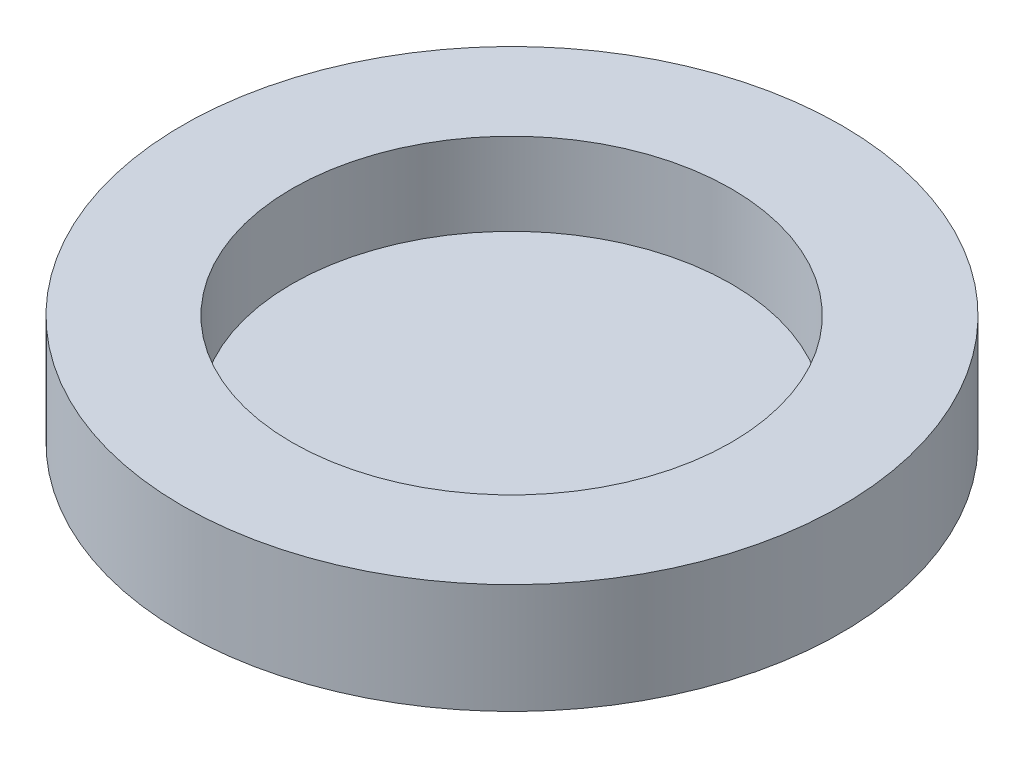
ISO-10303-21;
HEADER;
FILE_DESCRIPTION(('STEP AP214'),'2;1');
FILE_NAME('part.step','',(''),(''),'','','');
FILE_SCHEMA(('AUTOMOTIVE_DESIGN { 1 0 10303 214 1 1 1 1 }'));
ENDSEC;
DATA;
#1=APPLICATION_CONTEXT('core data for automotive mechanical design processes');
#2=APPLICATION_PROTOCOL_DEFINITION('international standard','automotive_design',2000,#1);
#3=PRODUCT_CONTEXT('',#1,'mechanical');
#4=PRODUCT('Part','Part','',(#3));
#5=PRODUCT_RELATED_PRODUCT_CATEGORY('part','',(#4));
#6=PRODUCT_DEFINITION_FORMATION('','',#4);
#7=PRODUCT_DEFINITION_CONTEXT('part definition',#1,'design');
#8=PRODUCT_DEFINITION('design','',#6,#7);
#9=PRODUCT_DEFINITION_SHAPE('','',#8);
#10=(LENGTH_UNIT() NAMED_UNIT(*) SI_UNIT(.MILLI.,.METRE.));
#11=(NAMED_UNIT(*) PLANE_ANGLE_UNIT() SI_UNIT($,.RADIAN.));
#12=(NAMED_UNIT(*) SI_UNIT($,.STERADIAN.) SOLID_ANGLE_UNIT());
#13=UNCERTAINTY_MEASURE_WITH_UNIT(LENGTH_MEASURE(1.E-05),#10,'distance_accuracy_value','');
#14=(GEOMETRIC_REPRESENTATION_CONTEXT(3) GLOBAL_UNCERTAINTY_ASSIGNED_CONTEXT((#13)) GLOBAL_UNIT_ASSIGNED_CONTEXT((#10,
#11,#12)) REPRESENTATION_CONTEXT('',''));
#15=CARTESIAN_POINT('',(0.,0.,0.));
#16=DIRECTION('',(0.,0.,1.));
#17=DIRECTION('',(1.,0.,0.));
#18=AXIS2_PLACEMENT_3D('',#15,#16,#17);
#19=CARTESIAN_POINT('',(0.353906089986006,20.,-0.176953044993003));
#20=DIRECTION('',(0.,-1.,0.));
#21=DIRECTION('',(0.,0.,-1.));
#22=AXIS2_PLACEMENT_3D('',#19,#20,#21);
#23=CYLINDRICAL_SURFACE('',#22,60.);
#24=CARTESIAN_POINT('',(0.353906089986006,20.,-0.176953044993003));
#25=DIRECTION('',(0.,1.,0.));
#26=DIRECTION('',(0.,0.,1.));
#27=AXIS2_PLACEMENT_3D('',#24,#25,#26);
#28=CIRCLE('',#27,60.);
#29=CARTESIAN_POINT('',(0.353906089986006,20.,-60.176953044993));
#30=VERTEX_POINT('',#29);
#31=EDGE_CURVE('E10',#30,#30,#28,.T.);
#32=CARTESIAN_POINT('',(0.353906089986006,0.,-0.176953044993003));
#33=DIRECTION('',(0.,1.,0.));
#34=DIRECTION('',(0.,0.,1.));
#35=AXIS2_PLACEMENT_3D('',#32,#33,#34);
#36=CIRCLE('',#35,60.);
#37=CARTESIAN_POINT('',(0.353906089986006,0.,-60.176953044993));
#38=VERTEX_POINT('',#37);
#39=EDGE_CURVE('E36',#38,#38,#36,.T.);
#40=CARTESIAN_POINT('',(0.353906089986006,20.,-60.176953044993));
#41=CARTESIAN_POINT('',(0.353906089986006,19.7916666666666,-60.176953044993));
#42=CARTESIAN_POINT('',(0.353906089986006,19.5833333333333,-60.176953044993));
#43=CARTESIAN_POINT('',(0.353906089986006,19.1666666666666,-60.176953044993));
#44=CARTESIAN_POINT('',(0.353906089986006,18.9583333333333,-60.176953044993));
#45=CARTESIAN_POINT('',(0.353906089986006,18.5416666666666,-60.176953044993));
#46=CARTESIAN_POINT('',(0.353906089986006,18.3333333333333,-60.176953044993));
#47=CARTESIAN_POINT('',(0.353906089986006,17.9166666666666,-60.176953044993));
#48=CARTESIAN_POINT('',(0.353906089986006,17.7083333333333,-60.176953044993));
#49=CARTESIAN_POINT('',(0.353906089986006,17.2916666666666,-60.176953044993));
#50=CARTESIAN_POINT('',(0.353906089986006,17.0833333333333,-60.176953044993));
#51=CARTESIAN_POINT('',(0.353906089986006,16.6666666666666,-60.176953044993));
#52=CARTESIAN_POINT('',(0.353906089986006,16.4583333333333,-60.176953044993));
#53=CARTESIAN_POINT('',(0.353906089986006,16.0416666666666,-60.176953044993));
#54=CARTESIAN_POINT('',(0.353906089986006,15.8333333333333,-60.176953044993));
#55=CARTESIAN_POINT('',(0.353906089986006,15.4166666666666,-60.176953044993));
#56=CARTESIAN_POINT('',(0.353906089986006,15.2083333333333,-60.176953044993));
#57=CARTESIAN_POINT('',(0.353906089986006,14.7916666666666,-60.176953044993));
#58=CARTESIAN_POINT('',(0.353906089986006,14.5833333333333,-60.176953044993));
#59=CARTESIAN_POINT('',(0.353906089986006,14.1666666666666,-60.176953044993));
#60=CARTESIAN_POINT('',(0.353906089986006,13.9583333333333,-60.176953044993));
#61=CARTESIAN_POINT('',(0.353906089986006,13.5416666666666,-60.176953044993));
#62=CARTESIAN_POINT('',(0.353906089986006,13.3333333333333,-60.176953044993));
#63=CARTESIAN_POINT('',(0.353906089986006,12.9166666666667,-60.176953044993));
#64=CARTESIAN_POINT('',(0.353906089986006,12.7083333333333,-60.176953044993));
#65=CARTESIAN_POINT('',(0.353906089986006,12.2916666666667,-60.176953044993));
#66=CARTESIAN_POINT('',(0.353906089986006,12.0833333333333,-60.176953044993));
#67=CARTESIAN_POINT('',(0.353906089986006,11.6666666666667,-60.176953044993));
#68=CARTESIAN_POINT('',(0.353906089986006,11.4583333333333,-60.176953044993));
#69=CARTESIAN_POINT('',(0.353906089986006,11.0416666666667,-60.176953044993));
#70=CARTESIAN_POINT('',(0.353906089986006,10.8333333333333,-60.176953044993));
#71=CARTESIAN_POINT('',(0.353906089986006,10.4166666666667,-60.176953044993));
#72=CARTESIAN_POINT('',(0.353906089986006,10.2083333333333,-60.176953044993));
#73=CARTESIAN_POINT('',(0.353906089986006,9.79166666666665,-60.176953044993));
#74=CARTESIAN_POINT('',(0.353906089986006,9.58333333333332,-60.176953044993));
#75=CARTESIAN_POINT('',(0.353906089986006,9.16666666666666,-60.176953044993));
#76=CARTESIAN_POINT('',(0.353906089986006,8.95833333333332,-60.176953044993));
#77=CARTESIAN_POINT('',(0.353906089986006,8.54166666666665,-60.176953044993));
#78=CARTESIAN_POINT('',(0.353906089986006,8.33333333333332,-60.176953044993));
#79=CARTESIAN_POINT('',(0.353906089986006,7.91666666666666,-60.176953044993));
#80=CARTESIAN_POINT('',(0.353906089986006,7.70833333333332,-60.176953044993));
#81=CARTESIAN_POINT('',(0.353906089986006,7.29166666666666,-60.176953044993));
#82=CARTESIAN_POINT('',(0.353906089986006,7.08333333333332,-60.176953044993));
#83=CARTESIAN_POINT('',(0.353906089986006,6.66666666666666,-60.176953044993));
#84=CARTESIAN_POINT('',(0.353906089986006,6.45833333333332,-60.176953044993));
#85=CARTESIAN_POINT('',(0.353906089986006,6.04166666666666,-60.176953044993));
#86=CARTESIAN_POINT('',(0.353906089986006,5.83333333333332,-60.176953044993));
#87=CARTESIAN_POINT('',(0.353906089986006,5.41666666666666,-60.176953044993));
#88=CARTESIAN_POINT('',(0.353906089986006,5.20833333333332,-60.176953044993));
#89=CARTESIAN_POINT('',(0.353906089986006,4.79166666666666,-60.176953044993));
#90=CARTESIAN_POINT('',(0.353906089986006,4.58333333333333,-60.176953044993));
#91=CARTESIAN_POINT('',(0.353906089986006,4.16666666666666,-60.176953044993));
#92=CARTESIAN_POINT('',(0.353906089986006,3.95833333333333,-60.176953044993));
#93=CARTESIAN_POINT('',(0.353906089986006,3.54166666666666,-60.176953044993));
#94=CARTESIAN_POINT('',(0.353906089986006,3.33333333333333,-60.176953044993));
#95=CARTESIAN_POINT('',(0.353906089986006,2.91666666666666,-60.176953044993));
#96=CARTESIAN_POINT('',(0.353906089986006,2.70833333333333,-60.176953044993));
#97=CARTESIAN_POINT('',(0.353906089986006,2.29166666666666,-60.176953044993));
#98=CARTESIAN_POINT('',(0.353906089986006,2.08333333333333,-60.176953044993));
#99=CARTESIAN_POINT('',(0.353906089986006,1.66666666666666,-60.176953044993));
#100=CARTESIAN_POINT('',(0.353906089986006,1.45833333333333,-60.176953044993));
#101=CARTESIAN_POINT('',(0.353906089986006,1.04166666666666,-60.176953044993));
#102=CARTESIAN_POINT('',(0.353906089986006,0.83333333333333,-60.176953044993));
#103=CARTESIAN_POINT('',(0.353906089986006,0.416666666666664,-60.176953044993));
#104=CARTESIAN_POINT('',(0.353906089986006,0.20833333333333,-60.176953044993));
#105=CARTESIAN_POINT('',(0.353906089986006,0.,-60.176953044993));
#106=B_SPLINE_CURVE_WITH_KNOTS('',3,(#40,#41,#42,#43,#44,#45,#46,#47,#48,#49,#50,#51,#52,#53,
#54,#55,#56,#57,#58,#59,#60,#61,#62,#63,#64,#65,#66,#67,#68,#69,#70,#71,#72,#73,#74,#75,#76,#77,
#78,#79,#80,#81,#82,#83,#84,#85,#86,#87,#88,#89,#90,#91,#92,#93,#94,#95,#96,#97,#98,#99,#100,
#101,#102,#103,#104,#105),.UNSPECIFIED.,.F.,.F.,(4,2,2,2,2,2,2,2,2,2,2,2,2,2,2,2,2,2,2,2,2,2,2,
2,2,2,2,2,2,2,2,2,4),(0.,0.624999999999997,1.25,1.87499999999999,2.5,3.125,3.74999999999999,
4.37499999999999,4.99999999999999,5.62499999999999,6.24999999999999,6.87499999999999,
7.49999999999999,8.12499999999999,8.74999999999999,9.37499999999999,9.99999999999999,10.625,
11.25,11.875,12.5,13.125,13.75,14.375,15.,15.625,16.25,16.875,17.5,18.125,18.75,19.375,20.),.UNSPECIFIED.);
#107=EDGE_CURVE('BSEAM33',#30,#38,#106,.T.);
#108=ORIENTED_EDGE('',*,*,#31,.F.);
#109=ORIENTED_EDGE('',*,*,#39,.T.);
#110=ORIENTED_EDGE('',*,*,#107,.T.);
#111=ORIENTED_EDGE('',*,*,#107,.F.);
#112=EDGE_LOOP('',(#108,#110,#109,#111));
#113=FACE_BOUND('',#112,.T.);
#114=ADVANCED_FACE('F33',(#113),#23,.T.);
#115=CARTESIAN_POINT('',(0.353906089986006,20.,-0.176953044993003));
#116=DIRECTION('',(0.,1.,0.));
#117=DIRECTION('',(0.,0.,1.));
#118=AXIS2_PLACEMENT_3D('',#115,#116,#117);
#119=PLANE('',#118);
#120=CARTESIAN_POINT('',(0.318726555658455,20.,-0.145648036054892));
#121=DIRECTION('',(0.,1.,0.));
#122=DIRECTION('',(0.,0.,1.));
#123=AXIS2_PLACEMENT_3D('',#120,#121,#122);
#124=CIRCLE('',#123,40.);
#125=CARTESIAN_POINT('',(0.318726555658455,20.,39.8543519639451));
#126=VERTEX_POINT('',#125);
#127=EDGE_CURVE('E45',#126,#126,#124,.T.);
#128=ORIENTED_EDGE('',*,*,#127,.F.);
#129=EDGE_LOOP('',(#128));
#130=FACE_BOUND('',#129,.T.);
#131=ORIENTED_EDGE('',*,*,#31,.T.);
#132=EDGE_LOOP('',(#131));
#133=FACE_BOUND('',#132,.T.);
#134=ADVANCED_FACE('F60',(#130,#133),#119,.T.);
#135=CARTESIAN_POINT('',(0.353906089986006,0.,-0.176953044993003));
#136=DIRECTION('',(0.,1.,0.));
#137=DIRECTION('',(0.,0.,1.));
#138=AXIS2_PLACEMENT_3D('',#135,#136,#137);
#139=PLANE('',#138);
#140=ORIENTED_EDGE('',*,*,#39,.F.);
#141=EDGE_LOOP('',(#140));
#142=FACE_BOUND('',#141,.T.);
#143=ADVANCED_FACE('F56',(#142),#139,.F.);
#144=CARTESIAN_POINT('',(0.318726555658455,4.99999999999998,-0.145648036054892));
#145=DIRECTION('',(0.,1.,0.));
#146=DIRECTION('',(0.,0.,1.));
#147=AXIS2_PLACEMENT_3D('',#144,#145,#146);
#148=CYLINDRICAL_SURFACE('',#147,40.);
#149=CARTESIAN_POINT('',(0.318726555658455,4.99999999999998,-0.145648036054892));
#150=DIRECTION('',(0.,1.,0.));
#151=DIRECTION('',(0.,0.,1.));
#152=AXIS2_PLACEMENT_3D('',#149,#150,#151);
#153=CIRCLE('',#152,40.);
#154=CARTESIAN_POINT('',(0.318726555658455,4.99999999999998,39.8543519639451));
#155=VERTEX_POINT('',#154);
#156=EDGE_CURVE('E43',#155,#155,#153,.T.);
#157=ORIENTED_EDGE('',*,*,#156,.F.);
#158=EDGE_LOOP('',(#157));
#159=FACE_BOUND('',#158,.T.);
#160=ORIENTED_EDGE('',*,*,#127,.T.);
#161=EDGE_LOOP('',(#160));
#162=FACE_BOUND('',#161,.T.);
#163=ADVANCED_FACE('F53',(#159,#162),#148,.F.);
#164=CARTESIAN_POINT('',(0.318726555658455,4.99999999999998,-0.145648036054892));
#165=DIRECTION('',(0.,1.,0.));
#166=DIRECTION('',(0.,0.,1.));
#167=AXIS2_PLACEMENT_3D('',#164,#165,#166);
#168=PLANE('',#167);
#169=ORIENTED_EDGE('',*,*,#156,.T.);
#170=EDGE_LOOP('',(#169));
#171=FACE_BOUND('',#170,.T.);
#172=ADVANCED_FACE('F51',(#171),#168,.T.);
#173=CLOSED_SHELL('',(#114,#134,#143,#163,#172));
#174=MANIFOLD_SOLID_BREP('B2',#173);
#175=ADVANCED_BREP_SHAPE_REPRESENTATION('',(#18,#174),#14);
#176=SHAPE_DEFINITION_REPRESENTATION(#9,#175);
ENDSEC;
END-ISO-10303-21;
